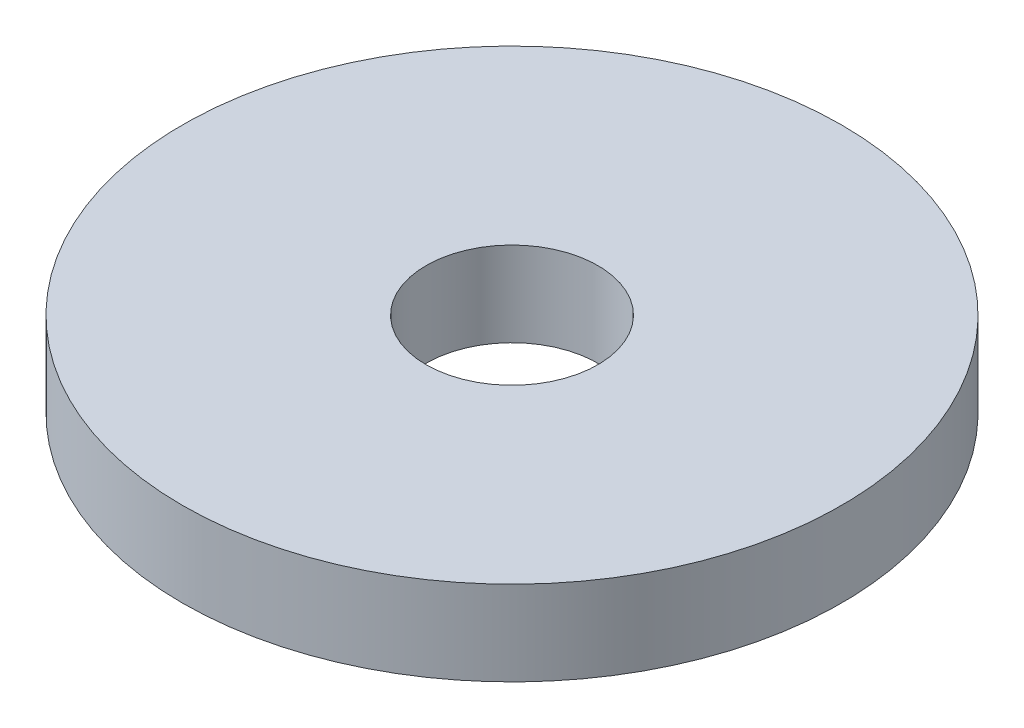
from build123d import *

# Parameters (mm, degrees)
SKETCH2_R           = 12.85
SKETCH2_R_2         = 3.35
BOSS_EXTRUDE1_DEPTH = 3.3


with BuildPart() as part:
    # Sketch2 → Boss-Extrude1 (new body)
    with BuildSketch(Plane(origin=(0, 0, 0), x_dir=(1, 0, 0), z_dir=(0, 1, 0))):
        with Locations(Location((0, 0, 0), (0, 0, 270))):
            Circle(SKETCH2_R)
        with Locations(Location((0, 0, 0), (0, 0, 270))):
            Circle(SKETCH2_R_2, mode=Mode.SUBTRACT)
    extrude(amount=BOSS_EXTRUDE1_DEPTH)


solid = part.part
